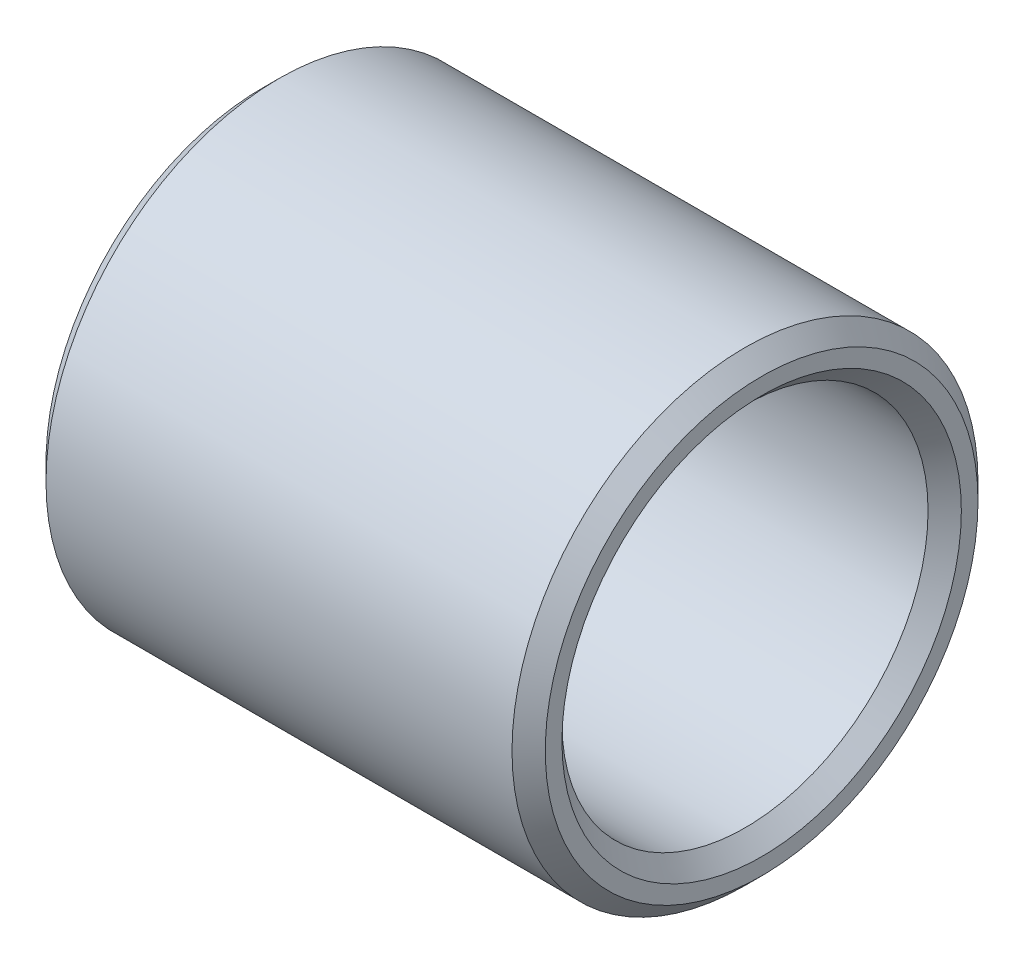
from build123d import *


with BuildPart() as part:
    # Esquisse1 → R_volution1 (revolve)
    with BuildSketch(Plane.XY, mode=Mode.PRIVATE) as r_volution1_sk:
        Polygon((0, 12), (1, 11), (29, 11), (30, 12), (30, 13), (29, 14), (1, 14), (0, 13), align=None)
    revolve(r_volution1_sk.sketch.rotate(Axis((30, 0, 0), (-1, 0, 0)), 90), axis=Axis((30, 0, 0), (-1, 0, 0)))


solid = part.part
